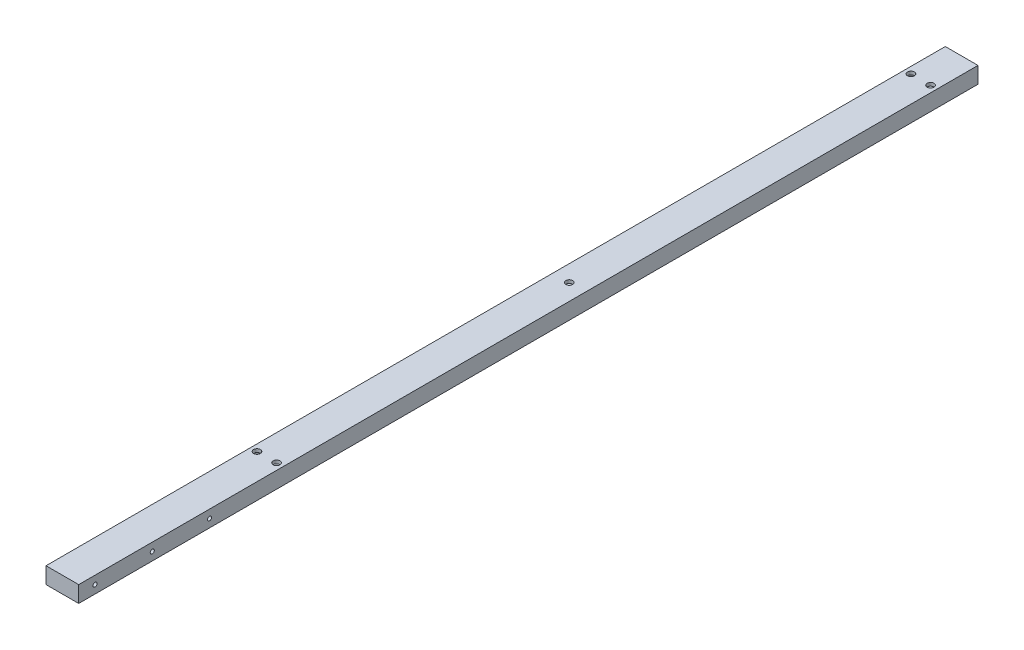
from build123d import *

# Parameters (mm, degrees)
SKETCH_1_W              = 20
SKETCH_1_H              = 10
SKETCH_1_W_2            = 16
SKETCH_1_H_2            = 6
EXTRUDE_1_DEPTH         = 450
HOLE_WIZARD_4_2_4_2_1_D = 4.2
HOLE_WIZARD_4_2_4_2_2_D = 4.2
SKETCH_8_W              = 20
SKETCH_8_H              = 10
EXTRUDE_2_DEPTH         = 100
HOLE_WIZARD_2_5_2_5_1_D = 2.5


with BuildPart() as part:
    # Sketch 1 → Extrude 1 (new body)
    with BuildSketch(Plane.XY):
        Rectangle(SKETCH_1_W, SKETCH_1_H)
        Rectangle(SKETCH_1_W_2, SKETCH_1_H_2, mode=Mode.SUBTRACT)
    extrude(amount=EXTRUDE_1_DEPTH)

    # Hole Wizard 4.2 _4.2_ _1 (through all)
    with Locations(Plane(origin=(0, 5, 0), x_dir=(1, 0, 0), z_dir=(0, 1, 0))):
        with Locations((-6, -425), (6, -425), (-6, -25), (6, -25)):
            Hole(HOLE_WIZARD_4_2_4_2_1_D / 2)

    # Hole Wizard 4.2 _4.2_ _2 (through all)
    with Locations(Plane(origin=(0, -5, 0), x_dir=(-1, 0, 0), z_dir=(0, -1, 0))):
        with Locations((0, -240)):
            Hole(HOLE_WIZARD_4_2_4_2_2_D / 2)

    # Sketch 8 → Extrude 2 (add)
    with BuildSketch(Plane(origin=(0, 0, 450), x_dir=(-1, 0, 0), z_dir=(0, 0, -1))):
        Rectangle(SKETCH_8_W, SKETCH_8_H)
    extrude(amount=-EXTRUDE_2_DEPTH)

    # Hole Wizard 2.5 _2.5_ _1 (through all)
    with Locations(Plane.ZY.offset(10)):
        with Locations((540, 0), (505, 0), (470, 0)):
            Hole(HOLE_WIZARD_2_5_2_5_1_D / 2)


solid = part.part
